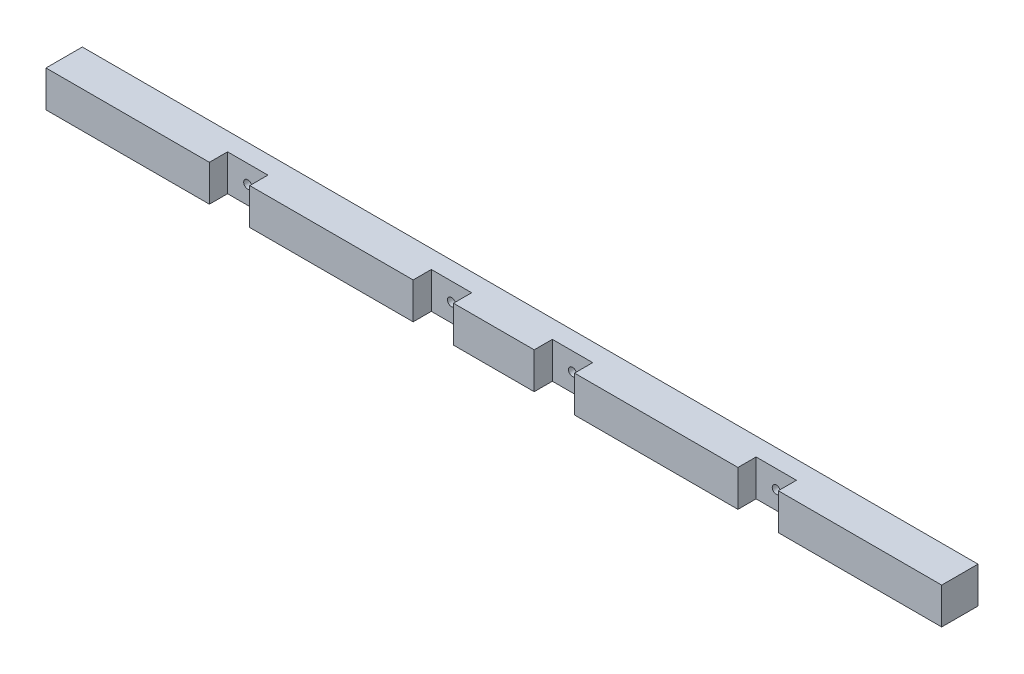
from build123d import *

# Parameters (mm, degrees)
ESQUISSE1_W             = 222
ESQUISSE1_H             = 9
EXTRUSION1_DEPTH        = 9
ESQUISSE2_W             = 10
ESQUISSE2_H             = 9
ENL_V_MAT_EXTRU_1_DEPTH = 4.5
ESQUISSE3_R             = 1
ENL_V_MAT_EXTRU_2_DEPTH = 4.5
ESQUISSE4_W             = 10
ESQUISSE4_H             = 9
ENL_V_MAT_EXTRU_3_DEPTH = 4.5
ESQUISSE5_R             = 1
ENL_V_MAT_EXTRU_4_DEPTH = 4.5
ESQUISSE6_W             = 10
ESQUISSE6_H             = 9
ENL_V_MAT_EXTRU_5_DEPTH = 4.5
ESQUISSE7_R             = 1
ENL_V_MAT_EXTRU_6_DEPTH = 4.5
ESQUISSE8_W             = 10
ESQUISSE8_H             = 9
ENL_V_MAT_EXTRU_7_DEPTH = 4.5
ESQUISSE9_R             = 1
ENL_V_MAT_EXTRU_8_DEPTH = 4.5


with BuildPart() as part:
    # Esquisse1 → Extrusion1 (new body)
    with BuildSketch(Plane.XY):
        with Locations((111, 4.5)):
            Rectangle(ESQUISSE1_W, ESQUISSE1_H)
    extrude(amount=EXTRUSION1_DEPTH)

    # Esquisse2 → Enl_v. mat.-Extru.1 (cut)
    with BuildSketch(Plane.XY.offset(9)):
        with Locations((45.5, 4.5)):
            Rectangle(ESQUISSE2_W, ESQUISSE2_H)
    extrude(amount=-ENL_V_MAT_EXTRU_1_DEPTH, mode=Mode.SUBTRACT)

    # Esquisse3 → Enl_v. mat.-Extru.2 (cut)
    with BuildSketch(Plane.XY.offset(4.5)):
        with Locations((45.5, 4.5)):
            Circle(ESQUISSE3_R)
    extrude(amount=-ENL_V_MAT_EXTRU_2_DEPTH, mode=Mode.SUBTRACT)

    # Esquisse4 → Enl_v. mat.-Extru.3 (cut)
    with BuildSketch(Plane.XY.offset(9)):
        with Locations((96, 4.5)):
            Rectangle(ESQUISSE4_W, ESQUISSE4_H)
    extrude(amount=-ENL_V_MAT_EXTRU_3_DEPTH, mode=Mode.SUBTRACT)

    # Esquisse5 → Enl_v. mat.-Extru.4 (cut)
    with BuildSketch(Plane.XY.offset(4.5)):
        with Locations((96, 4.5)):
            Circle(ESQUISSE5_R)
    extrude(amount=-ENL_V_MAT_EXTRU_4_DEPTH, mode=Mode.SUBTRACT)

    # Esquisse6 → Enl_v. mat.-Extru.5 (cut)
    with BuildSketch(Plane.XY.offset(9)):
        with Locations((126, 4.5)):
            Rectangle(ESQUISSE6_W, ESQUISSE6_H)
    extrude(amount=-ENL_V_MAT_EXTRU_5_DEPTH, mode=Mode.SUBTRACT)

    # Esquisse7 → Enl_v. mat.-Extru.6 (cut)
    with BuildSketch(Plane.XY.offset(4.5)):
        with Locations((126, 4.5)):
            Circle(ESQUISSE7_R)
    extrude(amount=-ENL_V_MAT_EXTRU_6_DEPTH, mode=Mode.SUBTRACT)

    # Esquisse8 → Enl_v. mat.-Extru.7 (cut)
    with BuildSketch(Plane.XY.offset(9)):
        with Locations((176.5, 4.5)):
            Rectangle(ESQUISSE8_W, ESQUISSE8_H)
    extrude(amount=-ENL_V_MAT_EXTRU_7_DEPTH, mode=Mode.SUBTRACT)

    # Esquisse9 → Enl_v. mat.-Extru.8 (cut)
    with BuildSketch(Plane.XY.offset(4.5)):
        with Locations((176.5, 4.5)):
            Circle(ESQUISSE9_R)
    extrude(amount=-ENL_V_MAT_EXTRU_8_DEPTH, mode=Mode.SUBTRACT)


solid = part.part
